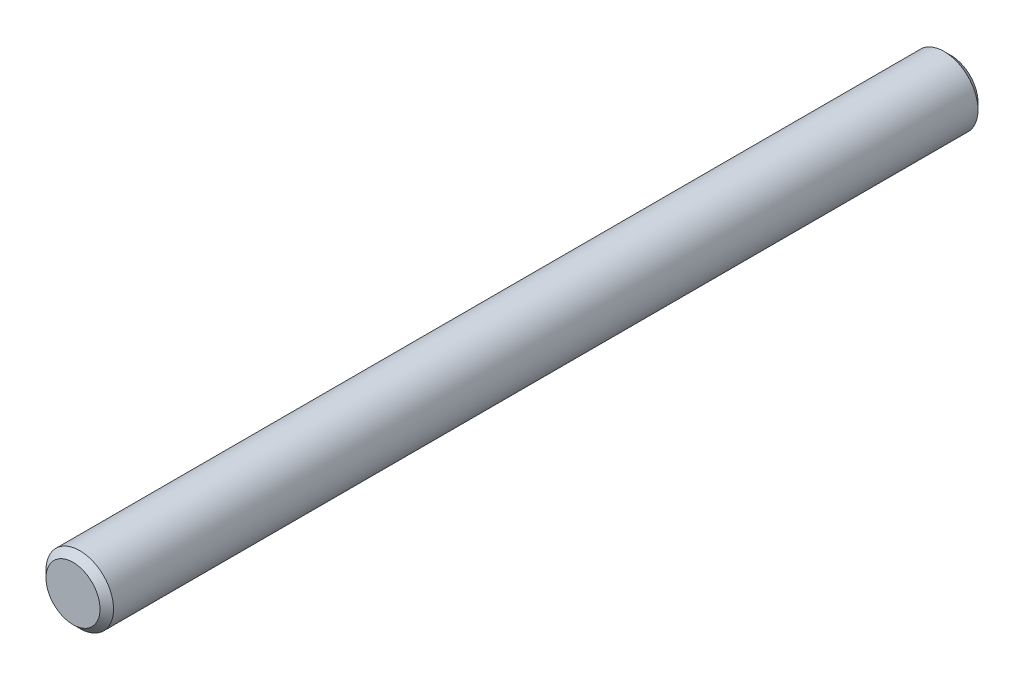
ISO-10303-21;
HEADER;
FILE_DESCRIPTION(('STEP AP214'),'2;1');
FILE_NAME('part.step','',(''),(''),'','','');
FILE_SCHEMA(('AUTOMOTIVE_DESIGN { 1 0 10303 214 1 1 1 1 }'));
ENDSEC;
DATA;
#1=APPLICATION_CONTEXT('core data for automotive mechanical design processes');
#2=APPLICATION_PROTOCOL_DEFINITION('international standard','automotive_design',2000,#1);
#3=PRODUCT_CONTEXT('',#1,'mechanical');
#4=PRODUCT('Part','Part','',(#3));
#5=PRODUCT_RELATED_PRODUCT_CATEGORY('part','',(#4));
#6=PRODUCT_DEFINITION_FORMATION('','',#4);
#7=PRODUCT_DEFINITION_CONTEXT('part definition',#1,'design');
#8=PRODUCT_DEFINITION('design','',#6,#7);
#9=PRODUCT_DEFINITION_SHAPE('','',#8);
#10=(LENGTH_UNIT() NAMED_UNIT(*) SI_UNIT(.MILLI.,.METRE.));
#11=(NAMED_UNIT(*) PLANE_ANGLE_UNIT() SI_UNIT($,.RADIAN.));
#12=(NAMED_UNIT(*) SI_UNIT($,.STERADIAN.) SOLID_ANGLE_UNIT());
#13=UNCERTAINTY_MEASURE_WITH_UNIT(LENGTH_MEASURE(1.E-05),#10,'distance_accuracy_value','');
#14=(GEOMETRIC_REPRESENTATION_CONTEXT(3) GLOBAL_UNCERTAINTY_ASSIGNED_CONTEXT((#13)) GLOBAL_UNIT_ASSIGNED_CONTEXT((#10,
#11,#12)) REPRESENTATION_CONTEXT('',''));
#15=CARTESIAN_POINT('',(0.,0.,0.));
#16=DIRECTION('',(0.,0.,1.));
#17=DIRECTION('',(1.,0.,0.));
#18=AXIS2_PLACEMENT_3D('',#15,#16,#17);
#19=CARTESIAN_POINT('',(-1.77635683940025E-12,-2.22044604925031E-13,130.));
#20=DIRECTION('',(0.,0.,-0.999999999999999));
#21=DIRECTION('',(-1.,0.,0.));
#22=AXIS2_PLACEMENT_3D('',#19,#20,#21);
#23=CYLINDRICAL_SURFACE('',#22,5.);
#24=CARTESIAN_POINT('',(0.,0.,0.99999999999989));
#25=DIRECTION('',(0.,0.,0.999999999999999));
#26=DIRECTION('',(1.,0.,0.));
#27=AXIS2_PLACEMENT_3D('',#24,#25,#26);
#28=CIRCLE('',#27,5.);
#29=CARTESIAN_POINT('',(-5.00000000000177,-2.38010684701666E-13,0.999999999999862));
#30=VERTEX_POINT('',#29);
#31=EDGE_CURVE('E42',#30,#30,#28,.T.);
#32=CARTESIAN_POINT('',(0.,0.,129.));
#33=DIRECTION('',(0.,0.,0.999999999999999));
#34=DIRECTION('',(1.,0.,0.));
#35=AXIS2_PLACEMENT_3D('',#32,#33,#34);
#36=CIRCLE('',#35,5.);
#37=CARTESIAN_POINT('',(-5.00000000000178,-2.22170490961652E-13,129.));
#38=VERTEX_POINT('',#37);
#39=EDGE_CURVE('E46',#38,#38,#36,.F.);
#40=CARTESIAN_POINT('',(-5.00000000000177,-2.38010684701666E-13,0.999999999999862));
#41=CARTESIAN_POINT('',(-5.00000000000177,-2.3784568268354E-13,2.3333333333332));
#42=CARTESIAN_POINT('',(-5.00000000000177,-2.37680680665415E-13,3.66666666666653));
#43=CARTESIAN_POINT('',(-5.00000000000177,-2.37350676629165E-13,6.3333333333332));
#44=CARTESIAN_POINT('',(-5.00000000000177,-2.3718567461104E-13,7.66666666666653));
#45=CARTESIAN_POINT('',(-5.00000000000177,-2.3685567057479E-13,10.3333333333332));
#46=CARTESIAN_POINT('',(-5.00000000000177,-2.36690668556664E-13,11.6666666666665));
#47=CARTESIAN_POINT('',(-5.00000000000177,-2.36360664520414E-13,14.3333333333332));
#48=CARTESIAN_POINT('',(-5.00000000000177,-2.36195662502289E-13,15.6666666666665));
#49=CARTESIAN_POINT('',(-5.00000000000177,-2.35865658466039E-13,18.3333333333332));
#50=CARTESIAN_POINT('',(-5.00000000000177,-2.35700656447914E-13,19.6666666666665));
#51=CARTESIAN_POINT('',(-5.00000000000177,-2.35370652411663E-13,22.3333333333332));
#52=CARTESIAN_POINT('',(-5.00000000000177,-2.35205650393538E-13,23.6666666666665));
#53=CARTESIAN_POINT('',(-5.00000000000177,-2.34875646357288E-13,26.3333333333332));
#54=CARTESIAN_POINT('',(-5.00000000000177,-2.34710644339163E-13,27.6666666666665));
#55=CARTESIAN_POINT('',(-5.00000000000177,-2.34380640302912E-13,30.3333333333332));
#56=CARTESIAN_POINT('',(-5.00000000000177,-2.34215638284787E-13,31.6666666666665));
#57=CARTESIAN_POINT('',(-5.00000000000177,-2.33885634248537E-13,34.3333333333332));
#58=CARTESIAN_POINT('',(-5.00000000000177,-2.33720632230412E-13,35.6666666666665));
#59=CARTESIAN_POINT('',(-5.00000000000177,-2.33390628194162E-13,38.3333333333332));
#60=CARTESIAN_POINT('',(-5.00000000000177,-2.33225626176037E-13,39.6666666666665));
#61=CARTESIAN_POINT('',(-5.00000000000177,-2.32895622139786E-13,42.3333333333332));
#62=CARTESIAN_POINT('',(-5.00000000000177,-2.32730620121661E-13,43.6666666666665));
#63=CARTESIAN_POINT('',(-5.00000000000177,-2.32400616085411E-13,46.3333333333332));
#64=CARTESIAN_POINT('',(-5.00000000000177,-2.32235614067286E-13,47.6666666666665));
#65=CARTESIAN_POINT('',(-5.00000000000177,-2.31905610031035E-13,50.3333333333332));
#66=CARTESIAN_POINT('',(-5.00000000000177,-2.3174060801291E-13,51.6666666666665));
#67=CARTESIAN_POINT('',(-5.00000000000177,-2.3141060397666E-13,54.3333333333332));
#68=CARTESIAN_POINT('',(-5.00000000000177,-2.31245601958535E-13,55.6666666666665));
#69=CARTESIAN_POINT('',(-5.00000000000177,-2.30915597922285E-13,58.3333333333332));
#70=CARTESIAN_POINT('',(-5.00000000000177,-2.30750595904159E-13,59.6666666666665));
#71=CARTESIAN_POINT('',(-5.00000000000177,-2.30420591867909E-13,62.3333333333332));
#72=CARTESIAN_POINT('',(-5.00000000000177,-2.30255589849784E-13,63.6666666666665));
#73=CARTESIAN_POINT('',(-5.00000000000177,-2.29925585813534E-13,66.3333333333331));
#74=CARTESIAN_POINT('',(-5.00000000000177,-2.29760583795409E-13,67.6666666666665));
#75=CARTESIAN_POINT('',(-5.00000000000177,-2.29430579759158E-13,70.3333333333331));
#76=CARTESIAN_POINT('',(-5.00000000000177,-2.29265577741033E-13,71.6666666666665));
#77=CARTESIAN_POINT('',(-5.00000000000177,-2.28935573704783E-13,74.3333333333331));
#78=CARTESIAN_POINT('',(-5.00000000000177,-2.28770571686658E-13,75.6666666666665));
#79=CARTESIAN_POINT('',(-5.00000000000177,-2.28440567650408E-13,78.3333333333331));
#80=CARTESIAN_POINT('',(-5.00000000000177,-2.28275565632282E-13,79.6666666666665));
#81=CARTESIAN_POINT('',(-5.00000000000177,-2.27945561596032E-13,82.3333333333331));
#82=CARTESIAN_POINT('',(-5.00000000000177,-2.27780559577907E-13,83.6666666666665));
#83=CARTESIAN_POINT('',(-5.00000000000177,-2.27450555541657E-13,86.3333333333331));
#84=CARTESIAN_POINT('',(-5.00000000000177,-2.27285553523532E-13,87.6666666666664));
#85=CARTESIAN_POINT('',(-5.00000000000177,-2.26955549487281E-13,90.3333333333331));
#86=CARTESIAN_POINT('',(-5.00000000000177,-2.26790547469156E-13,91.6666666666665));
#87=CARTESIAN_POINT('',(-5.00000000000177,-2.26460543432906E-13,94.3333333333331));
#88=CARTESIAN_POINT('',(-5.00000000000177,-2.26295541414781E-13,95.6666666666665));
#89=CARTESIAN_POINT('',(-5.00000000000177,-2.2596553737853E-13,98.3333333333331));
#90=CARTESIAN_POINT('',(-5.00000000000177,-2.25800535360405E-13,99.6666666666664));
#91=CARTESIAN_POINT('',(-5.00000000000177,-2.25470531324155E-13,102.333333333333));
#92=CARTESIAN_POINT('',(-5.00000000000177,-2.2530552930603E-13,103.666666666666));
#93=CARTESIAN_POINT('',(-5.00000000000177,-2.2497552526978E-13,106.333333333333));
#94=CARTESIAN_POINT('',(-5.00000000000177,-2.24810523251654E-13,107.666666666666));
#95=CARTESIAN_POINT('',(-5.00000000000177,-2.24480519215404E-13,110.333333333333));
#96=CARTESIAN_POINT('',(-5.00000000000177,-2.24315517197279E-13,111.666666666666));
#97=CARTESIAN_POINT('',(-5.00000000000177,-2.23985513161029E-13,114.333333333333));
#98=CARTESIAN_POINT('',(-5.00000000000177,-2.23820511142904E-13,115.666666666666));
#99=CARTESIAN_POINT('',(-5.00000000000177,-2.23490507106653E-13,118.333333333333));
#100=CARTESIAN_POINT('',(-5.00000000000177,-2.23325505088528E-13,119.666666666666));
#101=CARTESIAN_POINT('',(-5.00000000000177,-2.22995501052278E-13,122.333333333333));
#102=CARTESIAN_POINT('',(-5.00000000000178,-2.22830499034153E-13,123.666666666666));
#103=CARTESIAN_POINT('',(-5.00000000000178,-2.22500494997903E-13,126.333333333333));
#104=CARTESIAN_POINT('',(-5.00000000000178,-2.22335492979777E-13,127.666666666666));
#105=CARTESIAN_POINT('',(-5.00000000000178,-2.22170490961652E-13,129.));
#106=B_SPLINE_CURVE_WITH_KNOTS('',3,(#40,#41,#42,#43,#44,#45,#46,#47,#48,#49,#50,#51,#52,#53,
#54,#55,#56,#57,#58,#59,#60,#61,#62,#63,#64,#65,#66,#67,#68,#69,#70,#71,#72,#73,#74,#75,#76,#77,
#78,#79,#80,#81,#82,#83,#84,#85,#86,#87,#88,#89,#90,#91,#92,#93,#94,#95,#96,#97,#98,#99,#100,
#101,#102,#103,#104,#105),.UNSPECIFIED.,.F.,.F.,(4,2,2,2,2,2,2,2,2,2,2,2,2,2,2,2,2,2,2,2,2,2,2,
2,2,2,2,2,2,2,2,2,4),(0.,4.,7.99999999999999,12.,16.,20.,24.,28.,32.,36.,40.,44.,48.,52.,56.,
60.,63.9999999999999,67.9999999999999,71.9999999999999,75.9999999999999,79.9999999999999,
83.9999999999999,87.9999999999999,91.9999999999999,95.9999999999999,99.9999999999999,104.,108.,
112.,116.,120.,124.,128.),.UNSPECIFIED.);
#107=EDGE_CURVE('BSEAM32',#30,#38,#106,.T.);
#108=ORIENTED_EDGE('',*,*,#31,.T.);
#109=ORIENTED_EDGE('',*,*,#39,.T.);
#110=ORIENTED_EDGE('',*,*,#107,.T.);
#111=ORIENTED_EDGE('',*,*,#107,.F.);
#112=EDGE_LOOP('',(#108,#110,#109,#111));
#113=FACE_BOUND('',#112,.T.);
#114=ADVANCED_FACE('F32',(#113),#23,.T.);
#115=CARTESIAN_POINT('',(-1.77635683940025E-12,-2.22044604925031E-13,130.));
#116=DIRECTION('',(0.,0.,0.999999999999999));
#117=DIRECTION('',(1.,0.,0.));
#118=AXIS2_PLACEMENT_3D('',#115,#116,#117);
#119=PLANE('',#118);
#120=CARTESIAN_POINT('',(-1.77635683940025E-12,-2.22044604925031E-13,130.));
#121=DIRECTION('',(0.,0.,0.999999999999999));
#122=DIRECTION('',(1.,0.,0.));
#123=AXIS2_PLACEMENT_3D('',#120,#121,#122);
#124=CIRCLE('',#123,4.);
#125=CARTESIAN_POINT('',(-4.00000000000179,-2.22046312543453E-13,130.));
#126=VERTEX_POINT('',#125);
#127=EDGE_CURVE('E10',#126,#126,#124,.T.);
#128=ORIENTED_EDGE('',*,*,#127,.T.);
#129=EDGE_LOOP('',(#128));
#130=FACE_BOUND('',#129,.T.);
#131=ADVANCED_FACE('F65',(#130),#119,.T.);
#132=CARTESIAN_POINT('',(0.,0.,0.));
#133=DIRECTION('',(0.,0.,0.999999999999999));
#134=DIRECTION('',(1.,0.,0.));
#135=AXIS2_PLACEMENT_3D('',#132,#133,#134);
#136=PLANE('',#135);
#137=CARTESIAN_POINT('',(0.,0.,0.));
#138=DIRECTION('',(0.,0.,0.999999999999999));
#139=DIRECTION('',(1.,0.,0.));
#140=AXIS2_PLACEMENT_3D('',#137,#138,#139);
#141=CIRCLE('',#140,3.99999999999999);
#142=CARTESIAN_POINT('',(3.99999999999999,0.,0.));
#143=VERTEX_POINT('',#142);
#144=EDGE_CURVE('E38',#143,#143,#141,.F.);
#145=ORIENTED_EDGE('',*,*,#144,.T.);
#146=EDGE_LOOP('',(#145));
#147=FACE_BOUND('',#146,.T.);
#148=ADVANCED_FACE('F61',(#147),#136,.F.);
#149=CARTESIAN_POINT('',(0.,0.,0.99999999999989));
#150=DIRECTION('',(0.,0.,0.999999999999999));
#151=DIRECTION('',(1.,0.,0.));
#152=AXIS2_PLACEMENT_3D('',#149,#150,#151);
#153=CONICAL_SURFACE('',#152,5.,0.78539816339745);
#154=ORIENTED_EDGE('',*,*,#144,.F.);
#155=EDGE_LOOP('',(#154));
#156=FACE_BOUND('',#155,.T.);
#157=ORIENTED_EDGE('',*,*,#31,.F.);
#158=EDGE_LOOP('',(#157));
#159=FACE_BOUND('',#158,.T.);
#160=ADVANCED_FACE('F56',(#156,#159),#153,.T.);
#161=CARTESIAN_POINT('',(-1.77635683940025E-12,-2.22044604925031E-13,130.));
#162=DIRECTION('',(0.,0.,-0.999999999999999));
#163=DIRECTION('',(-1.,0.,0.));
#164=AXIS2_PLACEMENT_3D('',#161,#162,#163);
#165=CONICAL_SURFACE('',#164,4.,0.785398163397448);
#166=CARTESIAN_POINT('',(-5.0000000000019,-2.22170490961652E-13,129.));
#167=CARTESIAN_POINT('',(-4.98958333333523,-2.22169197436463E-13,129.010416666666));
#168=CARTESIAN_POINT('',(-4.97916666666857,-2.22167903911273E-13,129.020833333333));
#169=CARTESIAN_POINT('',(-4.95833333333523,-2.22165316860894E-13,129.041666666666));
#170=CARTESIAN_POINT('',(-4.94791666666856,-2.22164023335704E-13,129.052083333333));
#171=CARTESIAN_POINT('',(-4.92708333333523,-2.22161436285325E-13,129.072916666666));
#172=CARTESIAN_POINT('',(-4.91666666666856,-2.22160142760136E-13,129.083333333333));
#173=CARTESIAN_POINT('',(-4.89583333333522,-2.22157555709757E-13,129.104166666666));
#174=CARTESIAN_POINT('',(-4.88541666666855,-2.22156262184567E-13,129.114583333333));
#175=CARTESIAN_POINT('',(-4.86458333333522,-2.22153675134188E-13,129.135416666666));
#176=CARTESIAN_POINT('',(-4.85416666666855,-2.22152381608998E-13,129.145833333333));
#177=CARTESIAN_POINT('',(-4.83333333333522,-2.22149794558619E-13,129.166666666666));
#178=CARTESIAN_POINT('',(-4.82291666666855,-2.22148501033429E-13,129.177083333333));
#179=CARTESIAN_POINT('',(-4.80208333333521,-2.2214591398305E-13,129.197916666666));
#180=CARTESIAN_POINT('',(-4.79166666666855,-2.22144620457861E-13,129.208333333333));
#181=CARTESIAN_POINT('',(-4.77083333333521,-2.22142033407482E-13,129.229166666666));
#182=CARTESIAN_POINT('',(-4.76041666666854,-2.22140739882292E-13,129.239583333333));
#183=CARTESIAN_POINT('',(-4.7395833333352,-2.22138152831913E-13,129.260416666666));
#184=CARTESIAN_POINT('',(-4.72916666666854,-2.22136859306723E-13,129.270833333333));
#185=CARTESIAN_POINT('',(-4.7083333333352,-2.22134272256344E-13,129.291666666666));
#186=CARTESIAN_POINT('',(-4.69791666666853,-2.22132978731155E-13,129.302083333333));
#187=CARTESIAN_POINT('',(-4.6770833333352,-2.22130391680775E-13,129.322916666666));
#188=CARTESIAN_POINT('',(-4.66666666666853,-2.22129098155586E-13,129.333333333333));
#189=CARTESIAN_POINT('',(-4.6458333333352,-2.22126511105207E-13,129.354166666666));
#190=CARTESIAN_POINT('',(-4.63541666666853,-2.22125217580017E-13,129.364583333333));
#191=CARTESIAN_POINT('',(-4.61458333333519,-2.22122630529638E-13,129.385416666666));
#192=CARTESIAN_POINT('',(-4.60416666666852,-2.22121337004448E-13,129.395833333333));
#193=CARTESIAN_POINT('',(-4.58333333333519,-2.22118749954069E-13,129.416666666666));
#194=CARTESIAN_POINT('',(-4.57291666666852,-2.2211745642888E-13,129.427083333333));
#195=CARTESIAN_POINT('',(-4.55208333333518,-2.22114869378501E-13,129.447916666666));
#196=CARTESIAN_POINT('',(-4.54166666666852,-2.22113575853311E-13,129.458333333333));
#197=CARTESIAN_POINT('',(-4.52083333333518,-2.22110988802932E-13,129.479166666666));
#198=CARTESIAN_POINT('',(-4.51041666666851,-2.22109695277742E-13,129.489583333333));
#199=CARTESIAN_POINT('',(-4.48958333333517,-2.22107108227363E-13,129.510416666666));
#200=CARTESIAN_POINT('',(-4.47916666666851,-2.22105814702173E-13,129.520833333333));
#201=CARTESIAN_POINT('',(-4.45833333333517,-2.22103227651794E-13,129.541666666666));
#202=CARTESIAN_POINT('',(-4.4479166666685,-2.22101934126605E-13,129.552083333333));
#203=CARTESIAN_POINT('',(-4.42708333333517,-2.22099347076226E-13,129.572916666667));
#204=CARTESIAN_POINT('',(-4.4166666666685,-2.22098053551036E-13,129.583333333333));
#205=CARTESIAN_POINT('',(-4.39583333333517,-2.22095466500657E-13,129.604166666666));
#206=CARTESIAN_POINT('',(-4.3854166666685,-2.22094172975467E-13,129.614583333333));
#207=CARTESIAN_POINT('',(-4.36458333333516,-2.22091585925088E-13,129.635416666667));
#208=CARTESIAN_POINT('',(-4.35416666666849,-2.22090292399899E-13,129.645833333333));
#209=CARTESIAN_POINT('',(-4.33333333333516,-2.22087705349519E-13,129.666666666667));
#210=CARTESIAN_POINT('',(-4.32291666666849,-2.2208641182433E-13,129.677083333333));
#211=CARTESIAN_POINT('',(-4.30208333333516,-2.22083824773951E-13,129.697916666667));
#212=CARTESIAN_POINT('',(-4.29166666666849,-2.22082531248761E-13,129.708333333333));
#213=CARTESIAN_POINT('',(-4.27083333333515,-2.22079944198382E-13,129.729166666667));
#214=CARTESIAN_POINT('',(-4.26041666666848,-2.22078650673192E-13,129.739583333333));
#215=CARTESIAN_POINT('',(-4.23958333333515,-2.22076063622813E-13,129.760416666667));
#216=CARTESIAN_POINT('',(-4.22916666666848,-2.22074770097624E-13,129.770833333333));
#217=CARTESIAN_POINT('',(-4.20833333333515,-2.22072183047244E-13,129.791666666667));
#218=CARTESIAN_POINT('',(-4.19791666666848,-2.22070889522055E-13,129.802083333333));
#219=CARTESIAN_POINT('',(-4.17708333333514,-2.22068302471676E-13,129.822916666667));
#220=CARTESIAN_POINT('',(-4.16666666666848,-2.22067008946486E-13,129.833333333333));
#221=CARTESIAN_POINT('',(-4.14583333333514,-2.22064421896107E-13,129.854166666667));
#222=CARTESIAN_POINT('',(-4.13541666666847,-2.22063128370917E-13,129.864583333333));
#223=CARTESIAN_POINT('',(-4.11458333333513,-2.22060541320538E-13,129.885416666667));
#224=CARTESIAN_POINT('',(-4.10416666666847,-2.22059247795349E-13,129.895833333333));
#225=CARTESIAN_POINT('',(-4.08333333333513,-2.2205666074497E-13,129.916666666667));
#226=CARTESIAN_POINT('',(-4.07291666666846,-2.2205536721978E-13,129.927083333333));
#227=CARTESIAN_POINT('',(-4.05208333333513,-2.22052780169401E-13,129.947916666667));
#228=CARTESIAN_POINT('',(-4.04166666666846,-2.22051486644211E-13,129.958333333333));
#229=CARTESIAN_POINT('',(-4.02083333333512,-2.22048899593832E-13,129.979166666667));
#230=CARTESIAN_POINT('',(-4.01041666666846,-2.22047606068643E-13,129.989583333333));
#231=CARTESIAN_POINT('',(-4.00000000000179,-2.22046312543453E-13,130.));
#232=B_SPLINE_CURVE_WITH_KNOTS('',3,(#166,#167,#168,#169,#170,#171,#172,#173,#174,#175,#176,
#177,#178,#179,#180,#181,#182,#183,#184,#185,#186,#187,#188,#189,#190,#191,#192,#193,#194,#195,
#196,#197,#198,#199,#200,#201,#202,#203,#204,#205,#206,#207,#208,#209,#210,#211,#212,#213,#214,
#215,#216,#217,#218,#219,#220,#221,#222,#223,#224,#225,#226,#227,#228,#229,#230,#231),
.UNSPECIFIED.,.F.,.F.,(4,2,2,2,2,2,2,2,2,2,2,2,2,2,2,2,2,2,2,2,2,2,2,2,2,2,2,2,2,2,2,2,4),(0.,
0.0441941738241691,0.0883883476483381,0.132582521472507,0.176776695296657,0.220970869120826,
0.265165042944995,0.309359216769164,0.353553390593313,0.397747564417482,0.441941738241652,
0.486135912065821,0.53033008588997,0.574524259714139,0.618718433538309,0.662912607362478,
0.707106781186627,0.751300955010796,0.795495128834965,0.839689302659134,0.883883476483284,
0.928077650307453,0.972271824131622,1.01646599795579,1.06066017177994,1.10485434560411,
1.14904851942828,1.19324269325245,1.2374368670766,1.28163104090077,1.32582521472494,
1.3700193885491,1.41421356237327),.UNSPECIFIED.);
#233=EDGE_CURVE('BSEAM53',#38,#126,#232,.T.);
#234=ORIENTED_EDGE('',*,*,#39,.F.);
#235=ORIENTED_EDGE('',*,*,#127,.F.);
#236=ORIENTED_EDGE('',*,*,#233,.T.);
#237=ORIENTED_EDGE('',*,*,#233,.F.);
#238=EDGE_LOOP('',(#234,#236,#235,#237));
#239=FACE_BOUND('',#238,.T.);
#240=ADVANCED_FACE('F53',(#239),#165,.T.);
#241=CLOSED_SHELL('',(#114,#131,#148,#160,#240));
#242=MANIFOLD_SOLID_BREP('B2',#241);
#243=ADVANCED_BREP_SHAPE_REPRESENTATION('',(#18,#242),#14);
#244=SHAPE_DEFINITION_REPRESENTATION(#9,#243);
ENDSEC;
END-ISO-10303-21;
